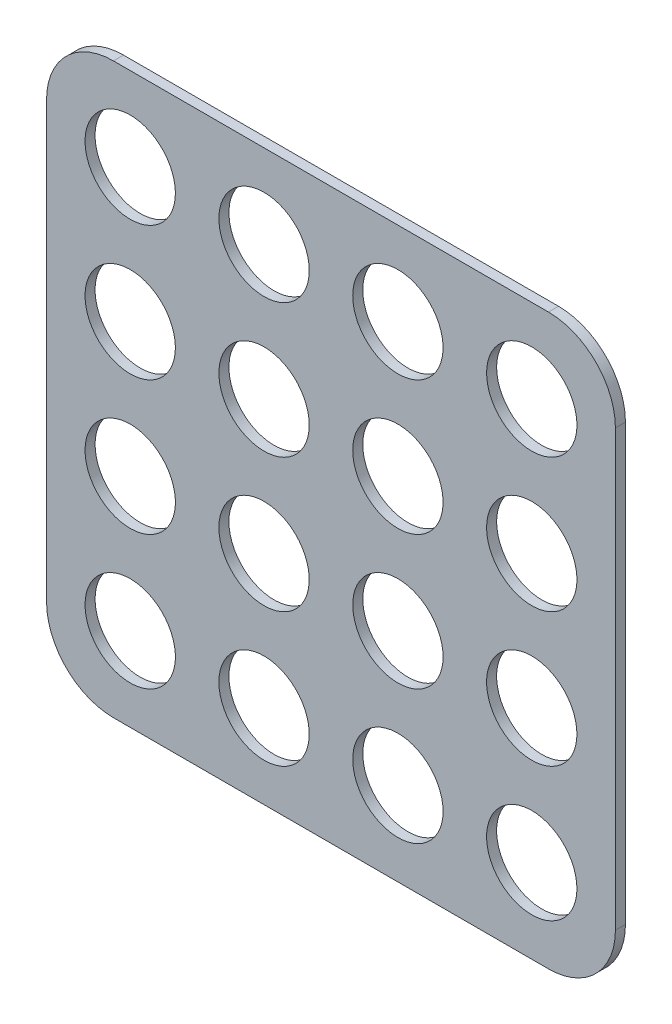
ISO-10303-21;
HEADER;
FILE_DESCRIPTION(('STEP AP214'),'2;1');
FILE_NAME('part.step','',(''),(''),'','','');
FILE_SCHEMA(('AUTOMOTIVE_DESIGN { 1 0 10303 214 1 1 1 1 }'));
ENDSEC;
DATA;
#1=APPLICATION_CONTEXT('core data for automotive mechanical design processes');
#2=APPLICATION_PROTOCOL_DEFINITION('international standard','automotive_design',2000,#1);
#3=PRODUCT_CONTEXT('',#1,'mechanical');
#4=PRODUCT('Part','Part','',(#3));
#5=PRODUCT_RELATED_PRODUCT_CATEGORY('part','',(#4));
#6=PRODUCT_DEFINITION_FORMATION('','',#4);
#7=PRODUCT_DEFINITION_CONTEXT('part definition',#1,'design');
#8=PRODUCT_DEFINITION('design','',#6,#7);
#9=PRODUCT_DEFINITION_SHAPE('','',#8);
#10=(LENGTH_UNIT() NAMED_UNIT(*) SI_UNIT(.MILLI.,.METRE.));
#11=(NAMED_UNIT(*) PLANE_ANGLE_UNIT() SI_UNIT($,.RADIAN.));
#12=(NAMED_UNIT(*) SI_UNIT($,.STERADIAN.) SOLID_ANGLE_UNIT());
#13=UNCERTAINTY_MEASURE_WITH_UNIT(LENGTH_MEASURE(1.E-05),#10,'distance_accuracy_value','');
#14=(GEOMETRIC_REPRESENTATION_CONTEXT(3) GLOBAL_UNCERTAINTY_ASSIGNED_CONTEXT((#13)) GLOBAL_UNIT_ASSIGNED_CONTEXT((#10,
#11,#12)) REPRESENTATION_CONTEXT('',''));
#15=CARTESIAN_POINT('',(0.,0.,0.));
#16=DIRECTION('',(0.,0.,1.));
#17=DIRECTION('',(1.,0.,0.));
#18=AXIS2_PLACEMENT_3D('',#15,#16,#17);
#19=CARTESIAN_POINT('',(0.,0.,3.));
#20=DIRECTION('',(1.,0.,0.));
#21=DIRECTION('',(0.,0.,-1.));
#22=AXIS2_PLACEMENT_3D('',#19,#20,#21);
#23=PLANE('',#22);
#24=DIRECTION('',(0.,-1.,0.));
#25=VECTOR('',#24,1.);
#26=CARTESIAN_POINT('',(0.,0.,0.));
#27=LINE('',#26,#25);
#28=CARTESIAN_POINT('',(0.,150.,0.));
#29=VERTEX_POINT('',#28);
#30=CARTESIAN_POINT('',(0.,20.,0.));
#31=VERTEX_POINT('',#30);
#32=EDGE_CURVE('E125',#29,#31,#27,.T.);
#33=ORIENTED_EDGE('',*,*,#32,.T.);
#34=DIRECTION('',(0.,0.,-1.));
#35=VECTOR('',#34,1.);
#36=CARTESIAN_POINT('',(0.,20.,3.));
#37=LINE('',#36,#35);
#38=CARTESIAN_POINT('',(0.,20.,3.));
#39=VERTEX_POINT('',#38);
#40=EDGE_CURVE('E103',#31,#39,#37,.F.);
#41=ORIENTED_EDGE('',*,*,#40,.T.);
#42=DIRECTION('',(0.,-1.,0.));
#43=VECTOR('',#42,1.);
#44=CARTESIAN_POINT('',(0.,0.,3.));
#45=LINE('',#44,#43);
#46=CARTESIAN_POINT('',(0.,150.,3.));
#47=VERTEX_POINT('',#46);
#48=EDGE_CURVE('E135',#47,#39,#45,.T.);
#49=ORIENTED_EDGE('',*,*,#48,.F.);
#50=DIRECTION('',(0.,0.,-1.));
#51=VECTOR('',#50,1.);
#52=CARTESIAN_POINT('',(0.,150.,3.));
#53=LINE('',#52,#51);
#54=EDGE_CURVE('E108',#47,#29,#53,.T.);
#55=ORIENTED_EDGE('',*,*,#54,.T.);
#56=EDGE_LOOP('',(#33,#41,#49,#55));
#57=FACE_BOUND('',#56,.T.);
#58=ADVANCED_FACE('F33',(#57),#23,.F.);
#59=CARTESIAN_POINT('',(0.,0.,3.));
#60=DIRECTION('',(0.,1.,0.));
#61=DIRECTION('',(0.,0.,1.));
#62=AXIS2_PLACEMENT_3D('',#59,#60,#61);
#63=PLANE('',#62);
#64=DIRECTION('',(1.,0.,0.));
#65=VECTOR('',#64,1.);
#66=CARTESIAN_POINT('',(0.,0.,3.));
#67=LINE('',#66,#65);
#68=CARTESIAN_POINT('',(20.,0.,3.));
#69=VERTEX_POINT('',#68);
#70=CARTESIAN_POINT('',(150.,0.,3.));
#71=VERTEX_POINT('',#70);
#72=EDGE_CURVE('E118',#69,#71,#67,.T.);
#73=ORIENTED_EDGE('',*,*,#72,.F.);
#74=DIRECTION('',(0.,0.,-1.));
#75=VECTOR('',#74,1.);
#76=CARTESIAN_POINT('',(20.,0.,3.));
#77=LINE('',#76,#75);
#78=CARTESIAN_POINT('',(20.,0.,0.));
#79=VERTEX_POINT('',#78);
#80=EDGE_CURVE('E102',#69,#79,#77,.T.);
#81=ORIENTED_EDGE('',*,*,#80,.T.);
#82=DIRECTION('',(1.,0.,0.));
#83=VECTOR('',#82,1.);
#84=CARTESIAN_POINT('',(0.,0.,0.));
#85=LINE('',#84,#83);
#86=CARTESIAN_POINT('',(150.,0.,0.));
#87=VERTEX_POINT('',#86);
#88=EDGE_CURVE('E115',#79,#87,#85,.T.);
#89=ORIENTED_EDGE('',*,*,#88,.T.);
#90=DIRECTION('',(0.,0.,-1.));
#91=VECTOR('',#90,1.);
#92=CARTESIAN_POINT('',(150.,0.,3.));
#93=LINE('',#92,#91);
#94=EDGE_CURVE('E120',#87,#71,#93,.F.);
#95=ORIENTED_EDGE('',*,*,#94,.T.);
#96=EDGE_LOOP('',(#73,#81,#89,#95));
#97=FACE_BOUND('',#96,.T.);
#98=ADVANCED_FACE('F114',(#97),#63,.F.);
#99=CARTESIAN_POINT('',(170.,0.,3.));
#100=DIRECTION('',(-1.,0.,0.));
#101=DIRECTION('',(0.,0.,1.));
#102=AXIS2_PLACEMENT_3D('',#99,#100,#101);
#103=PLANE('',#102);
#104=DIRECTION('',(0.,1.,0.));
#105=VECTOR('',#104,1.);
#106=CARTESIAN_POINT('',(170.,0.,3.));
#107=LINE('',#106,#105);
#108=CARTESIAN_POINT('',(170.,20.,3.));
#109=VERTEX_POINT('',#108);
#110=CARTESIAN_POINT('',(170.,150.,3.));
#111=VERTEX_POINT('',#110);
#112=EDGE_CURVE('E169',#109,#111,#107,.T.);
#113=ORIENTED_EDGE('',*,*,#112,.F.);
#114=DIRECTION('',(0.,0.,-1.));
#115=VECTOR('',#114,1.);
#116=CARTESIAN_POINT('',(170.,20.,3.));
#117=LINE('',#116,#115);
#118=CARTESIAN_POINT('',(170.,20.,0.));
#119=VERTEX_POINT('',#118);
#120=EDGE_CURVE('E154',#109,#119,#117,.T.);
#121=ORIENTED_EDGE('',*,*,#120,.T.);
#122=DIRECTION('',(0.,1.,0.));
#123=VECTOR('',#122,1.);
#124=CARTESIAN_POINT('',(170.,0.,0.));
#125=LINE('',#124,#123);
#126=CARTESIAN_POINT('',(170.,150.,0.));
#127=VERTEX_POINT('',#126);
#128=EDGE_CURVE('E124',#119,#127,#125,.T.);
#129=ORIENTED_EDGE('',*,*,#128,.T.);
#130=DIRECTION('',(0.,0.,-1.));
#131=VECTOR('',#130,1.);
#132=CARTESIAN_POINT('',(170.,150.,3.));
#133=LINE('',#132,#131);
#134=EDGE_CURVE('E152',#127,#111,#133,.F.);
#135=ORIENTED_EDGE('',*,*,#134,.T.);
#136=EDGE_LOOP('',(#113,#121,#129,#135));
#137=FACE_BOUND('',#136,.T.);
#138=ADVANCED_FACE('F185',(#137),#103,.F.);
#139=CARTESIAN_POINT('',(0.,170.,3.));
#140=DIRECTION('',(0.,-1.,0.));
#141=DIRECTION('',(0.,0.,-1.));
#142=AXIS2_PLACEMENT_3D('',#139,#140,#141);
#143=PLANE('',#142);
#144=DIRECTION('',(-1.,0.,0.));
#145=VECTOR('',#144,1.);
#146=CARTESIAN_POINT('',(0.,170.,0.));
#147=LINE('',#146,#145);
#148=CARTESIAN_POINT('',(150.,170.,0.));
#149=VERTEX_POINT('',#148);
#150=CARTESIAN_POINT('',(20.,170.,0.));
#151=VERTEX_POINT('',#150);
#152=EDGE_CURVE('E128',#149,#151,#147,.T.);
#153=ORIENTED_EDGE('',*,*,#152,.T.);
#154=DIRECTION('',(0.,0.,-1.));
#155=VECTOR('',#154,1.);
#156=CARTESIAN_POINT('',(20.,170.,3.));
#157=LINE('',#156,#155);
#158=CARTESIAN_POINT('',(20.,170.,3.));
#159=VERTEX_POINT('',#158);
#160=EDGE_CURVE('E11',#151,#159,#157,.F.);
#161=ORIENTED_EDGE('',*,*,#160,.T.);
#162=DIRECTION('',(-1.,0.,0.));
#163=VECTOR('',#162,1.);
#164=CARTESIAN_POINT('',(0.,170.,3.));
#165=LINE('',#164,#163);
#166=CARTESIAN_POINT('',(150.,170.,3.));
#167=VERTEX_POINT('',#166);
#168=EDGE_CURVE('E136',#167,#159,#165,.T.);
#169=ORIENTED_EDGE('',*,*,#168,.F.);
#170=DIRECTION('',(0.,0.,-1.));
#171=VECTOR('',#170,1.);
#172=CARTESIAN_POINT('',(150.,170.,3.));
#173=LINE('',#172,#171);
#174=EDGE_CURVE('E41',#167,#149,#173,.T.);
#175=ORIENTED_EDGE('',*,*,#174,.T.);
#176=EDGE_LOOP('',(#153,#161,#169,#175));
#177=FACE_BOUND('',#176,.T.);
#178=ADVANCED_FACE('F159',(#177),#143,.F.);
#179=CARTESIAN_POINT('',(0.,0.,3.));
#180=DIRECTION('',(0.,0.,-1.));
#181=DIRECTION('',(-1.,0.,0.));
#182=AXIS2_PLACEMENT_3D('',#179,#180,#181);
#183=PLANE('',#182);
#184=CARTESIAN_POINT('',(25.,25.,3.));
#185=DIRECTION('',(0.,0.,1.));
#186=DIRECTION('',(-1.,0.,0.));
#187=AXIS2_PLACEMENT_3D('',#184,#185,#186);
#188=CIRCLE('',#187,13.5);
#189=CARTESIAN_POINT('',(11.5,25.,3.));
#190=VERTEX_POINT('',#189);
#191=EDGE_CURVE('E421',#190,#190,#188,.T.);
#192=ORIENTED_EDGE('',*,*,#191,.F.);
#193=EDGE_LOOP('',(#192));
#194=FACE_BOUND('',#193,.T.);
#195=CARTESIAN_POINT('',(65.,25.,3.));
#196=DIRECTION('',(0.,0.,1.));
#197=DIRECTION('',(-1.,0.,0.));
#198=AXIS2_PLACEMENT_3D('',#195,#196,#197);
#199=CIRCLE('',#198,13.5);
#200=CARTESIAN_POINT('',(51.5,25.,3.));
#201=VERTEX_POINT('',#200);
#202=EDGE_CURVE('E423',#201,#201,#199,.T.);
#203=ORIENTED_EDGE('',*,*,#202,.F.);
#204=EDGE_LOOP('',(#203));
#205=FACE_BOUND('',#204,.T.);
#206=CARTESIAN_POINT('',(105.,25.,3.));
#207=DIRECTION('',(0.,0.,1.));
#208=DIRECTION('',(1.,0.,0.));
#209=AXIS2_PLACEMENT_3D('',#206,#207,#208);
#210=CIRCLE('',#209,13.5);
#211=CARTESIAN_POINT('',(118.5,25.,3.));
#212=VERTEX_POINT('',#211);
#213=EDGE_CURVE('E429',#212,#212,#210,.T.);
#214=ORIENTED_EDGE('',*,*,#213,.F.);
#215=EDGE_LOOP('',(#214));
#216=FACE_BOUND('',#215,.T.);
#217=CARTESIAN_POINT('',(145.,25.,3.));
#218=DIRECTION('',(0.,0.,1.));
#219=DIRECTION('',(1.,0.,0.));
#220=AXIS2_PLACEMENT_3D('',#217,#218,#219);
#221=CIRCLE('',#220,13.5);
#222=CARTESIAN_POINT('',(158.5,25.,3.));
#223=VERTEX_POINT('',#222);
#224=EDGE_CURVE('E435',#223,#223,#221,.T.);
#225=ORIENTED_EDGE('',*,*,#224,.F.);
#226=EDGE_LOOP('',(#225));
#227=FACE_BOUND('',#226,.T.);
#228=CARTESIAN_POINT('',(65.,65.,3.));
#229=DIRECTION('',(0.,0.,1.));
#230=DIRECTION('',(-1.,0.,0.));
#231=AXIS2_PLACEMENT_3D('',#228,#229,#230);
#232=CIRCLE('',#231,13.5);
#233=CARTESIAN_POINT('',(51.5,65.,3.));
#234=VERTEX_POINT('',#233);
#235=EDGE_CURVE('E441',#234,#234,#232,.T.);
#236=ORIENTED_EDGE('',*,*,#235,.F.);
#237=EDGE_LOOP('',(#236));
#238=FACE_BOUND('',#237,.T.);
#239=CARTESIAN_POINT('',(25.,65.,3.));
#240=DIRECTION('',(0.,0.,1.));
#241=DIRECTION('',(-1.,0.,0.));
#242=AXIS2_PLACEMENT_3D('',#239,#240,#241);
#243=CIRCLE('',#242,13.5);
#244=CARTESIAN_POINT('',(11.5,65.,3.));
#245=VERTEX_POINT('',#244);
#246=EDGE_CURVE('E447',#245,#245,#243,.T.);
#247=ORIENTED_EDGE('',*,*,#246,.F.);
#248=EDGE_LOOP('',(#247));
#249=FACE_BOUND('',#248,.T.);
#250=CARTESIAN_POINT('',(105.,65.,3.));
#251=DIRECTION('',(0.,0.,1.));
#252=DIRECTION('',(1.,0.,0.));
#253=AXIS2_PLACEMENT_3D('',#250,#251,#252);
#254=CIRCLE('',#253,13.5);
#255=CARTESIAN_POINT('',(118.5,65.,3.));
#256=VERTEX_POINT('',#255);
#257=EDGE_CURVE('E453',#256,#256,#254,.T.);
#258=ORIENTED_EDGE('',*,*,#257,.F.);
#259=EDGE_LOOP('',(#258));
#260=FACE_BOUND('',#259,.T.);
#261=CARTESIAN_POINT('',(145.,65.,3.));
#262=DIRECTION('',(0.,0.,1.));
#263=DIRECTION('',(1.,0.,0.));
#264=AXIS2_PLACEMENT_3D('',#261,#262,#263);
#265=CIRCLE('',#264,13.5);
#266=CARTESIAN_POINT('',(158.5,65.,3.));
#267=VERTEX_POINT('',#266);
#268=EDGE_CURVE('E459',#267,#267,#265,.T.);
#269=ORIENTED_EDGE('',*,*,#268,.F.);
#270=EDGE_LOOP('',(#269));
#271=FACE_BOUND('',#270,.T.);
#272=CARTESIAN_POINT('',(145.,145.,3.));
#273=DIRECTION('',(0.,0.,1.));
#274=DIRECTION('',(-1.,0.,0.));
#275=AXIS2_PLACEMENT_3D('',#272,#273,#274);
#276=CIRCLE('',#275,13.5);
#277=CARTESIAN_POINT('',(131.5,145.,3.));
#278=VERTEX_POINT('',#277);
#279=EDGE_CURVE('E465',#278,#278,#276,.T.);
#280=ORIENTED_EDGE('',*,*,#279,.F.);
#281=EDGE_LOOP('',(#280));
#282=FACE_BOUND('',#281,.T.);
#283=CARTESIAN_POINT('',(105.,145.,3.));
#284=DIRECTION('',(0.,0.,1.));
#285=DIRECTION('',(-1.,0.,0.));
#286=AXIS2_PLACEMENT_3D('',#283,#284,#285);
#287=CIRCLE('',#286,13.5);
#288=CARTESIAN_POINT('',(91.5,145.,3.));
#289=VERTEX_POINT('',#288);
#290=EDGE_CURVE('E471',#289,#289,#287,.T.);
#291=ORIENTED_EDGE('',*,*,#290,.F.);
#292=EDGE_LOOP('',(#291));
#293=FACE_BOUND('',#292,.T.);
#294=CARTESIAN_POINT('',(145.,105.,3.));
#295=DIRECTION('',(0.,0.,1.));
#296=DIRECTION('',(-1.,0.,0.));
#297=AXIS2_PLACEMENT_3D('',#294,#295,#296);
#298=CIRCLE('',#297,13.5);
#299=CARTESIAN_POINT('',(131.5,105.,3.));
#300=VERTEX_POINT('',#299);
#301=EDGE_CURVE('E477',#300,#300,#298,.T.);
#302=ORIENTED_EDGE('',*,*,#301,.F.);
#303=EDGE_LOOP('',(#302));
#304=FACE_BOUND('',#303,.T.);
#305=CARTESIAN_POINT('',(105.,105.,3.));
#306=DIRECTION('',(0.,0.,1.));
#307=DIRECTION('',(-1.,0.,0.));
#308=AXIS2_PLACEMENT_3D('',#305,#306,#307);
#309=CIRCLE('',#308,13.5);
#310=CARTESIAN_POINT('',(91.5,105.,3.));
#311=VERTEX_POINT('',#310);
#312=EDGE_CURVE('E483',#311,#311,#309,.T.);
#313=ORIENTED_EDGE('',*,*,#312,.F.);
#314=EDGE_LOOP('',(#313));
#315=FACE_BOUND('',#314,.T.);
#316=CARTESIAN_POINT('',(25.,105.,3.));
#317=DIRECTION('',(0.,0.,1.));
#318=DIRECTION('',(1.,0.,0.));
#319=AXIS2_PLACEMENT_3D('',#316,#317,#318);
#320=CIRCLE('',#319,13.5);
#321=CARTESIAN_POINT('',(38.5,105.,3.));
#322=VERTEX_POINT('',#321);
#323=EDGE_CURVE('E489',#322,#322,#320,.T.);
#324=ORIENTED_EDGE('',*,*,#323,.F.);
#325=EDGE_LOOP('',(#324));
#326=FACE_BOUND('',#325,.T.);
#327=CARTESIAN_POINT('',(65.,105.,3.));
#328=DIRECTION('',(0.,0.,1.));
#329=DIRECTION('',(1.,0.,0.));
#330=AXIS2_PLACEMENT_3D('',#327,#328,#329);
#331=CIRCLE('',#330,13.5);
#332=CARTESIAN_POINT('',(78.5,105.,3.));
#333=VERTEX_POINT('',#332);
#334=EDGE_CURVE('E495',#333,#333,#331,.T.);
#335=ORIENTED_EDGE('',*,*,#334,.F.);
#336=EDGE_LOOP('',(#335));
#337=FACE_BOUND('',#336,.T.);
#338=CARTESIAN_POINT('',(65.,145.,3.));
#339=DIRECTION('',(0.,0.,1.));
#340=DIRECTION('',(1.,0.,0.));
#341=AXIS2_PLACEMENT_3D('',#338,#339,#340);
#342=CIRCLE('',#341,13.5);
#343=CARTESIAN_POINT('',(78.5,145.,3.));
#344=VERTEX_POINT('',#343);
#345=EDGE_CURVE('E501',#344,#344,#342,.T.);
#346=ORIENTED_EDGE('',*,*,#345,.F.);
#347=EDGE_LOOP('',(#346));
#348=FACE_BOUND('',#347,.T.);
#349=CARTESIAN_POINT('',(25.,145.,3.));
#350=DIRECTION('',(0.,0.,1.));
#351=DIRECTION('',(1.,0.,0.));
#352=AXIS2_PLACEMENT_3D('',#349,#350,#351);
#353=CIRCLE('',#352,13.5);
#354=CARTESIAN_POINT('',(38.5,145.,3.));
#355=VERTEX_POINT('',#354);
#356=EDGE_CURVE('E172',#355,#355,#353,.T.);
#357=ORIENTED_EDGE('',*,*,#356,.F.);
#358=EDGE_LOOP('',(#357));
#359=FACE_BOUND('',#358,.T.);
#360=ORIENTED_EDGE('',*,*,#48,.T.);
#361=CARTESIAN_POINT('',(20.,20.,3.));
#362=DIRECTION('',(0.,0.,-1.));
#363=DIRECTION('',(-1.,0.,0.));
#364=AXIS2_PLACEMENT_3D('',#361,#362,#363);
#365=CIRCLE('',#364,20.);
#366=EDGE_CURVE('E150',#39,#69,#365,.F.);
#367=ORIENTED_EDGE('',*,*,#366,.T.);
#368=ORIENTED_EDGE('',*,*,#72,.T.);
#369=CARTESIAN_POINT('',(150.,20.,3.));
#370=DIRECTION('',(0.,0.,-1.));
#371=DIRECTION('',(-1.,0.,0.));
#372=AXIS2_PLACEMENT_3D('',#369,#370,#371);
#373=CIRCLE('',#372,20.);
#374=EDGE_CURVE('E148',#71,#109,#373,.F.);
#375=ORIENTED_EDGE('',*,*,#374,.T.);
#376=ORIENTED_EDGE('',*,*,#112,.T.);
#377=CARTESIAN_POINT('',(150.,150.,3.));
#378=DIRECTION('',(0.,0.,-1.));
#379=DIRECTION('',(-1.,0.,0.));
#380=AXIS2_PLACEMENT_3D('',#377,#378,#379);
#381=CIRCLE('',#380,20.);
#382=EDGE_CURVE('E53',#111,#167,#381,.F.);
#383=ORIENTED_EDGE('',*,*,#382,.T.);
#384=ORIENTED_EDGE('',*,*,#168,.T.);
#385=CARTESIAN_POINT('',(20.,150.,3.));
#386=DIRECTION('',(0.,0.,-1.));
#387=DIRECTION('',(-1.,0.,0.));
#388=AXIS2_PLACEMENT_3D('',#385,#386,#387);
#389=CIRCLE('',#388,20.);
#390=EDGE_CURVE('E146',#159,#47,#389,.F.);
#391=ORIENTED_EDGE('',*,*,#390,.T.);
#392=EDGE_LOOP('',(#360,#367,#368,#375,#376,#383,#384,#391));
#393=FACE_BOUND('',#392,.T.);
#394=ADVANCED_FACE('F175',(#194,#205,#216,#227,#238,#249,#260,#271,#282,#293,#304,#315,#326,
#337,#348,#359,#393),#183,.F.);
#395=CARTESIAN_POINT('',(0.,0.,0.));
#396=DIRECTION('',(0.,0.,-1.));
#397=DIRECTION('',(-1.,0.,0.));
#398=AXIS2_PLACEMENT_3D('',#395,#396,#397);
#399=PLANE('',#398);
#400=CARTESIAN_POINT('',(25.,25.,0.));
#401=DIRECTION('',(0.,0.,1.));
#402=DIRECTION('',(-1.,0.,0.));
#403=AXIS2_PLACEMENT_3D('',#400,#401,#402);
#404=CIRCLE('',#403,13.5);
#405=CARTESIAN_POINT('',(11.5,25.,0.));
#406=VERTEX_POINT('',#405);
#407=EDGE_CURVE('E419',#406,#406,#404,.T.);
#408=ORIENTED_EDGE('',*,*,#407,.T.);
#409=EDGE_LOOP('',(#408));
#410=FACE_BOUND('',#409,.T.);
#411=CARTESIAN_POINT('',(65.,25.,0.));
#412=DIRECTION('',(0.,0.,1.));
#413=DIRECTION('',(-1.,0.,0.));
#414=AXIS2_PLACEMENT_3D('',#411,#412,#413);
#415=CIRCLE('',#414,13.5);
#416=CARTESIAN_POINT('',(51.5,25.,0.));
#417=VERTEX_POINT('',#416);
#418=EDGE_CURVE('E426',#417,#417,#415,.T.);
#419=ORIENTED_EDGE('',*,*,#418,.T.);
#420=EDGE_LOOP('',(#419));
#421=FACE_BOUND('',#420,.T.);
#422=CARTESIAN_POINT('',(105.,25.,0.));
#423=DIRECTION('',(0.,0.,1.));
#424=DIRECTION('',(1.,0.,0.));
#425=AXIS2_PLACEMENT_3D('',#422,#423,#424);
#426=CIRCLE('',#425,13.5);
#427=CARTESIAN_POINT('',(118.5,25.,0.));
#428=VERTEX_POINT('',#427);
#429=EDGE_CURVE('E432',#428,#428,#426,.T.);
#430=ORIENTED_EDGE('',*,*,#429,.T.);
#431=EDGE_LOOP('',(#430));
#432=FACE_BOUND('',#431,.T.);
#433=CARTESIAN_POINT('',(145.,25.,0.));
#434=DIRECTION('',(0.,0.,1.));
#435=DIRECTION('',(1.,0.,0.));
#436=AXIS2_PLACEMENT_3D('',#433,#434,#435);
#437=CIRCLE('',#436,13.5);
#438=CARTESIAN_POINT('',(158.5,25.,0.));
#439=VERTEX_POINT('',#438);
#440=EDGE_CURVE('E438',#439,#439,#437,.T.);
#441=ORIENTED_EDGE('',*,*,#440,.T.);
#442=EDGE_LOOP('',(#441));
#443=FACE_BOUND('',#442,.T.);
#444=CARTESIAN_POINT('',(65.,65.,0.));
#445=DIRECTION('',(0.,0.,1.));
#446=DIRECTION('',(-1.,0.,0.));
#447=AXIS2_PLACEMENT_3D('',#444,#445,#446);
#448=CIRCLE('',#447,13.5);
#449=CARTESIAN_POINT('',(51.5,65.,0.));
#450=VERTEX_POINT('',#449);
#451=EDGE_CURVE('E444',#450,#450,#448,.T.);
#452=ORIENTED_EDGE('',*,*,#451,.T.);
#453=EDGE_LOOP('',(#452));
#454=FACE_BOUND('',#453,.T.);
#455=CARTESIAN_POINT('',(25.,65.,0.));
#456=DIRECTION('',(0.,0.,1.));
#457=DIRECTION('',(-1.,0.,0.));
#458=AXIS2_PLACEMENT_3D('',#455,#456,#457);
#459=CIRCLE('',#458,13.5);
#460=CARTESIAN_POINT('',(11.5,65.,0.));
#461=VERTEX_POINT('',#460);
#462=EDGE_CURVE('E450',#461,#461,#459,.T.);
#463=ORIENTED_EDGE('',*,*,#462,.T.);
#464=EDGE_LOOP('',(#463));
#465=FACE_BOUND('',#464,.T.);
#466=CARTESIAN_POINT('',(105.,65.,0.));
#467=DIRECTION('',(0.,0.,1.));
#468=DIRECTION('',(1.,0.,0.));
#469=AXIS2_PLACEMENT_3D('',#466,#467,#468);
#470=CIRCLE('',#469,13.5);
#471=CARTESIAN_POINT('',(118.5,65.,0.));
#472=VERTEX_POINT('',#471);
#473=EDGE_CURVE('E456',#472,#472,#470,.T.);
#474=ORIENTED_EDGE('',*,*,#473,.T.);
#475=EDGE_LOOP('',(#474));
#476=FACE_BOUND('',#475,.T.);
#477=CARTESIAN_POINT('',(145.,65.,0.));
#478=DIRECTION('',(0.,0.,1.));
#479=DIRECTION('',(1.,0.,0.));
#480=AXIS2_PLACEMENT_3D('',#477,#478,#479);
#481=CIRCLE('',#480,13.5);
#482=CARTESIAN_POINT('',(158.5,65.,0.));
#483=VERTEX_POINT('',#482);
#484=EDGE_CURVE('E462',#483,#483,#481,.T.);
#485=ORIENTED_EDGE('',*,*,#484,.T.);
#486=EDGE_LOOP('',(#485));
#487=FACE_BOUND('',#486,.T.);
#488=CARTESIAN_POINT('',(145.,145.,0.));
#489=DIRECTION('',(0.,0.,1.));
#490=DIRECTION('',(-1.,0.,0.));
#491=AXIS2_PLACEMENT_3D('',#488,#489,#490);
#492=CIRCLE('',#491,13.5);
#493=CARTESIAN_POINT('',(131.5,145.,0.));
#494=VERTEX_POINT('',#493);
#495=EDGE_CURVE('E468',#494,#494,#492,.T.);
#496=ORIENTED_EDGE('',*,*,#495,.T.);
#497=EDGE_LOOP('',(#496));
#498=FACE_BOUND('',#497,.T.);
#499=CARTESIAN_POINT('',(105.,145.,0.));
#500=DIRECTION('',(0.,0.,1.));
#501=DIRECTION('',(-1.,0.,0.));
#502=AXIS2_PLACEMENT_3D('',#499,#500,#501);
#503=CIRCLE('',#502,13.5);
#504=CARTESIAN_POINT('',(91.5,145.,0.));
#505=VERTEX_POINT('',#504);
#506=EDGE_CURVE('E474',#505,#505,#503,.T.);
#507=ORIENTED_EDGE('',*,*,#506,.T.);
#508=EDGE_LOOP('',(#507));
#509=FACE_BOUND('',#508,.T.);
#510=CARTESIAN_POINT('',(145.,105.,0.));
#511=DIRECTION('',(0.,0.,1.));
#512=DIRECTION('',(-1.,0.,0.));
#513=AXIS2_PLACEMENT_3D('',#510,#511,#512);
#514=CIRCLE('',#513,13.5);
#515=CARTESIAN_POINT('',(131.5,105.,0.));
#516=VERTEX_POINT('',#515);
#517=EDGE_CURVE('E480',#516,#516,#514,.T.);
#518=ORIENTED_EDGE('',*,*,#517,.T.);
#519=EDGE_LOOP('',(#518));
#520=FACE_BOUND('',#519,.T.);
#521=CARTESIAN_POINT('',(105.,105.,0.));
#522=DIRECTION('',(0.,0.,1.));
#523=DIRECTION('',(-1.,0.,0.));
#524=AXIS2_PLACEMENT_3D('',#521,#522,#523);
#525=CIRCLE('',#524,13.5);
#526=CARTESIAN_POINT('',(91.5,105.,0.));
#527=VERTEX_POINT('',#526);
#528=EDGE_CURVE('E486',#527,#527,#525,.T.);
#529=ORIENTED_EDGE('',*,*,#528,.T.);
#530=EDGE_LOOP('',(#529));
#531=FACE_BOUND('',#530,.T.);
#532=CARTESIAN_POINT('',(25.,105.,0.));
#533=DIRECTION('',(0.,0.,1.));
#534=DIRECTION('',(1.,0.,0.));
#535=AXIS2_PLACEMENT_3D('',#532,#533,#534);
#536=CIRCLE('',#535,13.5);
#537=CARTESIAN_POINT('',(38.5,105.,0.));
#538=VERTEX_POINT('',#537);
#539=EDGE_CURVE('E492',#538,#538,#536,.T.);
#540=ORIENTED_EDGE('',*,*,#539,.T.);
#541=EDGE_LOOP('',(#540));
#542=FACE_BOUND('',#541,.T.);
#543=CARTESIAN_POINT('',(65.,105.,0.));
#544=DIRECTION('',(0.,0.,1.));
#545=DIRECTION('',(1.,0.,0.));
#546=AXIS2_PLACEMENT_3D('',#543,#544,#545);
#547=CIRCLE('',#546,13.5);
#548=CARTESIAN_POINT('',(78.5,105.,0.));
#549=VERTEX_POINT('',#548);
#550=EDGE_CURVE('E498',#549,#549,#547,.T.);
#551=ORIENTED_EDGE('',*,*,#550,.T.);
#552=EDGE_LOOP('',(#551));
#553=FACE_BOUND('',#552,.T.);
#554=CARTESIAN_POINT('',(65.,145.,0.));
#555=DIRECTION('',(0.,0.,1.));
#556=DIRECTION('',(1.,0.,0.));
#557=AXIS2_PLACEMENT_3D('',#554,#555,#556);
#558=CIRCLE('',#557,13.5);
#559=CARTESIAN_POINT('',(78.5,145.,0.));
#560=VERTEX_POINT('',#559);
#561=EDGE_CURVE('E504',#560,#560,#558,.T.);
#562=ORIENTED_EDGE('',*,*,#561,.T.);
#563=EDGE_LOOP('',(#562));
#564=FACE_BOUND('',#563,.T.);
#565=CARTESIAN_POINT('',(25.,145.,0.));
#566=DIRECTION('',(0.,0.,1.));
#567=DIRECTION('',(1.,0.,0.));
#568=AXIS2_PLACEMENT_3D('',#565,#566,#567);
#569=CIRCLE('',#568,13.5);
#570=CARTESIAN_POINT('',(38.5,145.,0.));
#571=VERTEX_POINT('',#570);
#572=EDGE_CURVE('E130',#571,#571,#569,.T.);
#573=ORIENTED_EDGE('',*,*,#572,.T.);
#574=EDGE_LOOP('',(#573));
#575=FACE_BOUND('',#574,.T.);
#576=ORIENTED_EDGE('',*,*,#88,.F.);
#577=CARTESIAN_POINT('',(20.,20.,0.));
#578=DIRECTION('',(0.,0.,-1.));
#579=DIRECTION('',(-1.,0.,0.));
#580=AXIS2_PLACEMENT_3D('',#577,#578,#579);
#581=CIRCLE('',#580,20.);
#582=EDGE_CURVE('E98',#79,#31,#581,.T.);
#583=ORIENTED_EDGE('',*,*,#582,.T.);
#584=ORIENTED_EDGE('',*,*,#32,.F.);
#585=CARTESIAN_POINT('',(20.,150.,0.));
#586=DIRECTION('',(0.,0.,-1.));
#587=DIRECTION('',(-1.,0.,0.));
#588=AXIS2_PLACEMENT_3D('',#585,#586,#587);
#589=CIRCLE('',#588,20.);
#590=EDGE_CURVE('E139',#29,#151,#589,.T.);
#591=ORIENTED_EDGE('',*,*,#590,.T.);
#592=ORIENTED_EDGE('',*,*,#152,.F.);
#593=CARTESIAN_POINT('',(150.,150.,0.));
#594=DIRECTION('',(0.,0.,-1.));
#595=DIRECTION('',(-1.,0.,0.));
#596=AXIS2_PLACEMENT_3D('',#593,#594,#595);
#597=CIRCLE('',#596,20.);
#598=EDGE_CURVE('E119',#149,#127,#597,.T.);
#599=ORIENTED_EDGE('',*,*,#598,.T.);
#600=ORIENTED_EDGE('',*,*,#128,.F.);
#601=CARTESIAN_POINT('',(150.,20.,0.));
#602=DIRECTION('',(0.,0.,-1.));
#603=DIRECTION('',(-1.,0.,0.));
#604=AXIS2_PLACEMENT_3D('',#601,#602,#603);
#605=CIRCLE('',#604,20.);
#606=EDGE_CURVE('E109',#119,#87,#605,.T.);
#607=ORIENTED_EDGE('',*,*,#606,.T.);
#608=EDGE_LOOP('',(#576,#583,#584,#591,#592,#599,#600,#607));
#609=FACE_BOUND('',#608,.T.);
#610=ADVANCED_FACE('F122',(#410,#421,#432,#443,#454,#465,#476,#487,#498,#509,#520,#531,#542,
#553,#564,#575,#609),#399,.T.);
#611=CARTESIAN_POINT('',(20.,20.,3.));
#612=DIRECTION('',(0.,0.,-1.));
#613=DIRECTION('',(-1.,0.,0.));
#614=AXIS2_PLACEMENT_3D('',#611,#612,#613);
#615=CYLINDRICAL_SURFACE('',#614,20.);
#616=ORIENTED_EDGE('',*,*,#366,.F.);
#617=ORIENTED_EDGE('',*,*,#40,.F.);
#618=ORIENTED_EDGE('',*,*,#582,.F.);
#619=ORIENTED_EDGE('',*,*,#80,.F.);
#620=EDGE_LOOP('',(#616,#617,#618,#619));
#621=FACE_BOUND('',#620,.T.);
#622=ADVANCED_FACE('F101',(#621),#615,.T.);
#623=CARTESIAN_POINT('',(150.,20.,3.));
#624=DIRECTION('',(0.,0.,-1.));
#625=DIRECTION('',(-1.,0.,0.));
#626=AXIS2_PLACEMENT_3D('',#623,#624,#625);
#627=CYLINDRICAL_SURFACE('',#626,20.);
#628=ORIENTED_EDGE('',*,*,#374,.F.);
#629=ORIENTED_EDGE('',*,*,#94,.F.);
#630=ORIENTED_EDGE('',*,*,#606,.F.);
#631=ORIENTED_EDGE('',*,*,#120,.F.);
#632=EDGE_LOOP('',(#628,#629,#630,#631));
#633=FACE_BOUND('',#632,.T.);
#634=ADVANCED_FACE('F200',(#633),#627,.T.);
#635=CARTESIAN_POINT('',(20.,150.,3.));
#636=DIRECTION('',(0.,0.,-1.));
#637=DIRECTION('',(-1.,0.,0.));
#638=AXIS2_PLACEMENT_3D('',#635,#636,#637);
#639=CYLINDRICAL_SURFACE('',#638,20.);
#640=ORIENTED_EDGE('',*,*,#390,.F.);
#641=ORIENTED_EDGE('',*,*,#160,.F.);
#642=ORIENTED_EDGE('',*,*,#590,.F.);
#643=ORIENTED_EDGE('',*,*,#54,.F.);
#644=EDGE_LOOP('',(#640,#641,#642,#643));
#645=FACE_BOUND('',#644,.T.);
#646=ADVANCED_FACE('F164',(#645),#639,.T.);
#647=CARTESIAN_POINT('',(150.,150.,3.));
#648=DIRECTION('',(0.,0.,-1.));
#649=DIRECTION('',(-1.,0.,0.));
#650=AXIS2_PLACEMENT_3D('',#647,#648,#649);
#651=CYLINDRICAL_SURFACE('',#650,20.);
#652=ORIENTED_EDGE('',*,*,#382,.F.);
#653=ORIENTED_EDGE('',*,*,#134,.F.);
#654=ORIENTED_EDGE('',*,*,#598,.F.);
#655=ORIENTED_EDGE('',*,*,#174,.F.);
#656=EDGE_LOOP('',(#652,#653,#654,#655));
#657=FACE_BOUND('',#656,.T.);
#658=ADVANCED_FACE('F35',(#657),#651,.T.);
#659=CARTESIAN_POINT('',(25.,145.,0.));
#660=DIRECTION('',(0.,0.,1.));
#661=DIRECTION('',(1.,0.,0.));
#662=AXIS2_PLACEMENT_3D('',#659,#660,#661);
#663=CYLINDRICAL_SURFACE('',#662,13.5);
#664=ORIENTED_EDGE('',*,*,#572,.F.);
#665=EDGE_LOOP('',(#664));
#666=FACE_BOUND('',#665,.T.);
#667=ORIENTED_EDGE('',*,*,#356,.T.);
#668=EDGE_LOOP('',(#667));
#669=FACE_BOUND('',#668,.T.);
#670=ADVANCED_FACE('F207',(#666,#669),#663,.F.);
#671=CARTESIAN_POINT('',(65.,145.,0.));
#672=DIRECTION('',(0.,0.,1.));
#673=DIRECTION('',(1.,0.,0.));
#674=AXIS2_PLACEMENT_3D('',#671,#672,#673);
#675=CYLINDRICAL_SURFACE('',#674,13.5);
#676=ORIENTED_EDGE('',*,*,#561,.F.);
#677=EDGE_LOOP('',(#676));
#678=FACE_BOUND('',#677,.T.);
#679=ORIENTED_EDGE('',*,*,#345,.T.);
#680=EDGE_LOOP('',(#679));
#681=FACE_BOUND('',#680,.T.);
#682=ADVANCED_FACE('F211',(#678,#681),#675,.F.);
#683=CARTESIAN_POINT('',(65.,105.,0.));
#684=DIRECTION('',(0.,0.,1.));
#685=DIRECTION('',(1.,0.,0.));
#686=AXIS2_PLACEMENT_3D('',#683,#684,#685);
#687=CYLINDRICAL_SURFACE('',#686,13.5);
#688=ORIENTED_EDGE('',*,*,#550,.F.);
#689=EDGE_LOOP('',(#688));
#690=FACE_BOUND('',#689,.T.);
#691=ORIENTED_EDGE('',*,*,#334,.T.);
#692=EDGE_LOOP('',(#691));
#693=FACE_BOUND('',#692,.T.);
#694=ADVANCED_FACE('F272',(#690,#693),#687,.F.);
#695=CARTESIAN_POINT('',(25.,105.,0.));
#696=DIRECTION('',(0.,0.,1.));
#697=DIRECTION('',(1.,0.,0.));
#698=AXIS2_PLACEMENT_3D('',#695,#696,#697);
#699=CYLINDRICAL_SURFACE('',#698,13.5);
#700=ORIENTED_EDGE('',*,*,#539,.F.);
#701=EDGE_LOOP('',(#700));
#702=FACE_BOUND('',#701,.T.);
#703=ORIENTED_EDGE('',*,*,#323,.T.);
#704=EDGE_LOOP('',(#703));
#705=FACE_BOUND('',#704,.T.);
#706=ADVANCED_FACE('F282',(#702,#705),#699,.F.);
#707=CARTESIAN_POINT('',(105.,105.,0.));
#708=DIRECTION('',(0.,0.,1.));
#709=DIRECTION('',(1.,0.,0.));
#710=AXIS2_PLACEMENT_3D('',#707,#708,#709);
#711=CYLINDRICAL_SURFACE('',#710,13.5);
#712=ORIENTED_EDGE('',*,*,#528,.F.);
#713=EDGE_LOOP('',(#712));
#714=FACE_BOUND('',#713,.T.);
#715=ORIENTED_EDGE('',*,*,#312,.T.);
#716=EDGE_LOOP('',(#715));
#717=FACE_BOUND('',#716,.T.);
#718=ADVANCED_FACE('F292',(#714,#717),#711,.F.);
#719=CARTESIAN_POINT('',(145.,105.,0.));
#720=DIRECTION('',(0.,0.,1.));
#721=DIRECTION('',(1.,0.,0.));
#722=AXIS2_PLACEMENT_3D('',#719,#720,#721);
#723=CYLINDRICAL_SURFACE('',#722,13.5);
#724=ORIENTED_EDGE('',*,*,#517,.F.);
#725=EDGE_LOOP('',(#724));
#726=FACE_BOUND('',#725,.T.);
#727=ORIENTED_EDGE('',*,*,#301,.T.);
#728=EDGE_LOOP('',(#727));
#729=FACE_BOUND('',#728,.T.);
#730=ADVANCED_FACE('F302',(#726,#729),#723,.F.);
#731=CARTESIAN_POINT('',(105.,145.,0.));
#732=DIRECTION('',(0.,0.,1.));
#733=DIRECTION('',(1.,0.,0.));
#734=AXIS2_PLACEMENT_3D('',#731,#732,#733);
#735=CYLINDRICAL_SURFACE('',#734,13.5);
#736=ORIENTED_EDGE('',*,*,#506,.F.);
#737=EDGE_LOOP('',(#736));
#738=FACE_BOUND('',#737,.T.);
#739=ORIENTED_EDGE('',*,*,#290,.T.);
#740=EDGE_LOOP('',(#739));
#741=FACE_BOUND('',#740,.T.);
#742=ADVANCED_FACE('F312',(#738,#741),#735,.F.);
#743=CARTESIAN_POINT('',(145.,145.,0.));
#744=DIRECTION('',(0.,0.,1.));
#745=DIRECTION('',(1.,0.,0.));
#746=AXIS2_PLACEMENT_3D('',#743,#744,#745);
#747=CYLINDRICAL_SURFACE('',#746,13.5);
#748=ORIENTED_EDGE('',*,*,#495,.F.);
#749=EDGE_LOOP('',(#748));
#750=FACE_BOUND('',#749,.T.);
#751=ORIENTED_EDGE('',*,*,#279,.T.);
#752=EDGE_LOOP('',(#751));
#753=FACE_BOUND('',#752,.T.);
#754=ADVANCED_FACE('F322',(#750,#753),#747,.F.);
#755=CARTESIAN_POINT('',(145.,65.,0.));
#756=DIRECTION('',(0.,0.,1.));
#757=DIRECTION('',(1.,0.,0.));
#758=AXIS2_PLACEMENT_3D('',#755,#756,#757);
#759=CYLINDRICAL_SURFACE('',#758,13.5);
#760=ORIENTED_EDGE('',*,*,#484,.F.);
#761=EDGE_LOOP('',(#760));
#762=FACE_BOUND('',#761,.T.);
#763=ORIENTED_EDGE('',*,*,#268,.T.);
#764=EDGE_LOOP('',(#763));
#765=FACE_BOUND('',#764,.T.);
#766=ADVANCED_FACE('F332',(#762,#765),#759,.F.);
#767=CARTESIAN_POINT('',(105.,65.,0.));
#768=DIRECTION('',(0.,0.,1.));
#769=DIRECTION('',(1.,0.,0.));
#770=AXIS2_PLACEMENT_3D('',#767,#768,#769);
#771=CYLINDRICAL_SURFACE('',#770,13.5);
#772=ORIENTED_EDGE('',*,*,#473,.F.);
#773=EDGE_LOOP('',(#772));
#774=FACE_BOUND('',#773,.T.);
#775=ORIENTED_EDGE('',*,*,#257,.T.);
#776=EDGE_LOOP('',(#775));
#777=FACE_BOUND('',#776,.T.);
#778=ADVANCED_FACE('F342',(#774,#777),#771,.F.);
#779=CARTESIAN_POINT('',(25.,65.,0.));
#780=DIRECTION('',(0.,0.,1.));
#781=DIRECTION('',(1.,0.,0.));
#782=AXIS2_PLACEMENT_3D('',#779,#780,#781);
#783=CYLINDRICAL_SURFACE('',#782,13.5);
#784=ORIENTED_EDGE('',*,*,#462,.F.);
#785=EDGE_LOOP('',(#784));
#786=FACE_BOUND('',#785,.T.);
#787=ORIENTED_EDGE('',*,*,#246,.T.);
#788=EDGE_LOOP('',(#787));
#789=FACE_BOUND('',#788,.T.);
#790=ADVANCED_FACE('F352',(#786,#789),#783,.F.);
#791=CARTESIAN_POINT('',(65.,65.,0.));
#792=DIRECTION('',(0.,0.,1.));
#793=DIRECTION('',(1.,0.,0.));
#794=AXIS2_PLACEMENT_3D('',#791,#792,#793);
#795=CYLINDRICAL_SURFACE('',#794,13.5);
#796=ORIENTED_EDGE('',*,*,#451,.F.);
#797=EDGE_LOOP('',(#796));
#798=FACE_BOUND('',#797,.T.);
#799=ORIENTED_EDGE('',*,*,#235,.T.);
#800=EDGE_LOOP('',(#799));
#801=FACE_BOUND('',#800,.T.);
#802=ADVANCED_FACE('F362',(#798,#801),#795,.F.);
#803=CARTESIAN_POINT('',(145.,25.,0.));
#804=DIRECTION('',(0.,0.,1.));
#805=DIRECTION('',(1.,0.,0.));
#806=AXIS2_PLACEMENT_3D('',#803,#804,#805);
#807=CYLINDRICAL_SURFACE('',#806,13.5);
#808=ORIENTED_EDGE('',*,*,#440,.F.);
#809=EDGE_LOOP('',(#808));
#810=FACE_BOUND('',#809,.T.);
#811=ORIENTED_EDGE('',*,*,#224,.T.);
#812=EDGE_LOOP('',(#811));
#813=FACE_BOUND('',#812,.T.);
#814=ADVANCED_FACE('F372',(#810,#813),#807,.F.);
#815=CARTESIAN_POINT('',(105.,25.,0.));
#816=DIRECTION('',(0.,0.,1.));
#817=DIRECTION('',(1.,0.,0.));
#818=AXIS2_PLACEMENT_3D('',#815,#816,#817);
#819=CYLINDRICAL_SURFACE('',#818,13.5);
#820=ORIENTED_EDGE('',*,*,#429,.F.);
#821=EDGE_LOOP('',(#820));
#822=FACE_BOUND('',#821,.T.);
#823=ORIENTED_EDGE('',*,*,#213,.T.);
#824=EDGE_LOOP('',(#823));
#825=FACE_BOUND('',#824,.T.);
#826=ADVANCED_FACE('F382',(#822,#825),#819,.F.);
#827=CARTESIAN_POINT('',(65.,25.,0.));
#828=DIRECTION('',(0.,0.,1.));
#829=DIRECTION('',(1.,0.,0.));
#830=AXIS2_PLACEMENT_3D('',#827,#828,#829);
#831=CYLINDRICAL_SURFACE('',#830,13.5);
#832=ORIENTED_EDGE('',*,*,#418,.F.);
#833=EDGE_LOOP('',(#832));
#834=FACE_BOUND('',#833,.T.);
#835=ORIENTED_EDGE('',*,*,#202,.T.);
#836=EDGE_LOOP('',(#835));
#837=FACE_BOUND('',#836,.T.);
#838=ADVANCED_FACE('F392',(#834,#837),#831,.F.);
#839=CARTESIAN_POINT('',(25.,25.,0.));
#840=DIRECTION('',(0.,0.,1.));
#841=DIRECTION('',(1.,0.,0.));
#842=AXIS2_PLACEMENT_3D('',#839,#840,#841);
#843=CYLINDRICAL_SURFACE('',#842,13.5);
#844=ORIENTED_EDGE('',*,*,#407,.F.);
#845=EDGE_LOOP('',(#844));
#846=FACE_BOUND('',#845,.T.);
#847=ORIENTED_EDGE('',*,*,#191,.T.);
#848=EDGE_LOOP('',(#847));
#849=FACE_BOUND('',#848,.T.);
#850=ADVANCED_FACE('F402',(#846,#849),#843,.F.);
#851=CLOSED_SHELL('',(#58,#98,#138,#178,#394,#610,#622,#634,#646,#658,#670,#682,#694,#706,#718,
#730,#742,#754,#766,#778,#790,#802,#814,#826,#838,#850));
#852=MANIFOLD_SOLID_BREP('B2',#851);
#853=ADVANCED_BREP_SHAPE_REPRESENTATION('',(#18,#852),#14);
#854=SHAPE_DEFINITION_REPRESENTATION(#9,#853);
ENDSEC;
END-ISO-10303-21;
